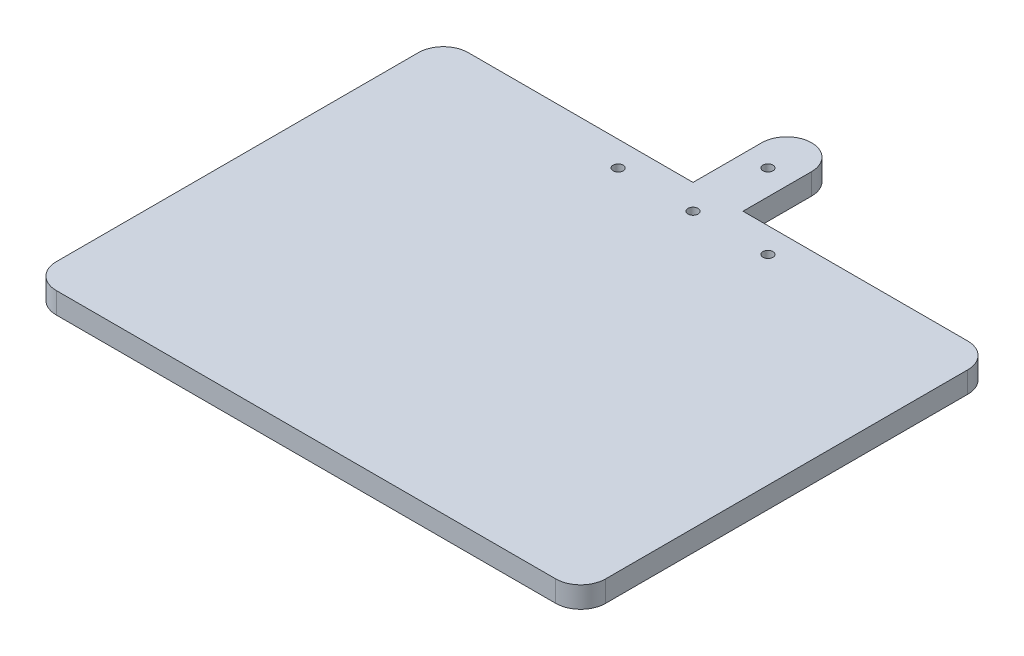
ISO-10303-21;
HEADER;
FILE_DESCRIPTION(('STEP AP214'),'2;1');
FILE_NAME('part.step','',(''),(''),'','','');
FILE_SCHEMA(('AUTOMOTIVE_DESIGN { 1 0 10303 214 1 1 1 1 }'));
ENDSEC;
DATA;
#1=APPLICATION_CONTEXT('core data for automotive mechanical design processes');
#2=APPLICATION_PROTOCOL_DEFINITION('international standard','automotive_design',2000,#1);
#3=PRODUCT_CONTEXT('',#1,'mechanical');
#4=PRODUCT('Part','Part','',(#3));
#5=PRODUCT_RELATED_PRODUCT_CATEGORY('part','',(#4));
#6=PRODUCT_DEFINITION_FORMATION('','',#4);
#7=PRODUCT_DEFINITION_CONTEXT('part definition',#1,'design');
#8=PRODUCT_DEFINITION('design','',#6,#7);
#9=PRODUCT_DEFINITION_SHAPE('','',#8);
#10=(LENGTH_UNIT() NAMED_UNIT(*) SI_UNIT(.MILLI.,.METRE.));
#11=(NAMED_UNIT(*) PLANE_ANGLE_UNIT() SI_UNIT($,.RADIAN.));
#12=(NAMED_UNIT(*) SI_UNIT($,.STERADIAN.) SOLID_ANGLE_UNIT());
#13=UNCERTAINTY_MEASURE_WITH_UNIT(LENGTH_MEASURE(1.E-05),#10,'distance_accuracy_value','');
#14=(GEOMETRIC_REPRESENTATION_CONTEXT(3) GLOBAL_UNCERTAINTY_ASSIGNED_CONTEXT((#13)) GLOBAL_UNIT_ASSIGNED_CONTEXT((#10,
#11,#12)) REPRESENTATION_CONTEXT('',''));
#15=CARTESIAN_POINT('',(0.,0.,0.));
#16=DIRECTION('',(0.,0.,1.));
#17=DIRECTION('',(1.,0.,0.));
#18=AXIS2_PLACEMENT_3D('',#15,#16,#17);
#19=CARTESIAN_POINT('',(0.,-8.5,-87.4904896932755));
#20=DIRECTION('',(0.,-1.,0.));
#21=DIRECTION('',(0.,0.,-1.));
#22=AXIS2_PLACEMENT_3D('',#19,#20,#21);
#23=CYLINDRICAL_SURFACE('',#22,1.99999999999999);
#24=CARTESIAN_POINT('',(0.,0.,-87.4904896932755));
#25=DIRECTION('',(0.,-1.,0.));
#26=DIRECTION('',(0.,0.,-1.));
#27=AXIS2_PLACEMENT_3D('',#24,#25,#26);
#28=CIRCLE('',#27,2.);
#29=CARTESIAN_POINT('',(0.,0.,-89.4904896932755));
#30=VERTEX_POINT('',#29);
#31=EDGE_CURVE('E185',#30,#30,#28,.T.);
#32=ORIENTED_EDGE('',*,*,#31,.F.);
#33=EDGE_LOOP('',(#32));
#34=FACE_BOUND('',#33,.T.);
#35=CARTESIAN_POINT('',(0.,-6.00000000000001,-87.4904896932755));
#36=DIRECTION('',(0.,-1.,0.));
#37=DIRECTION('',(0.,0.,-1.));
#38=AXIS2_PLACEMENT_3D('',#35,#36,#37);
#39=CIRCLE('',#38,1.99999999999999);
#40=CARTESIAN_POINT('',(0.,-6.00000000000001,-89.4904896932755));
#41=VERTEX_POINT('',#40);
#42=EDGE_CURVE('E75',#41,#41,#39,.F.);
#43=ORIENTED_EDGE('',*,*,#42,.F.);
#44=EDGE_LOOP('',(#43));
#45=FACE_BOUND('',#44,.T.);
#46=ADVANCED_FACE('F71',(#34,#45),#23,.F.);
#47=CARTESIAN_POINT('',(30.,-8.5,-57.4904896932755));
#48=DIRECTION('',(0.,-1.,0.));
#49=DIRECTION('',(0.,0.,-1.));
#50=AXIS2_PLACEMENT_3D('',#47,#48,#49);
#51=CYLINDRICAL_SURFACE('',#50,1.99999999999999);
#52=CARTESIAN_POINT('',(30.,0.,-57.4904896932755));
#53=DIRECTION('',(0.,-1.,0.));
#54=DIRECTION('',(0.,0.,-1.));
#55=AXIS2_PLACEMENT_3D('',#52,#53,#54);
#56=CIRCLE('',#55,1.99999999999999);
#57=CARTESIAN_POINT('',(30.,0.,-59.4904896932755));
#58=VERTEX_POINT('',#57);
#59=EDGE_CURVE('E281',#58,#58,#56,.T.);
#60=ORIENTED_EDGE('',*,*,#59,.F.);
#61=EDGE_LOOP('',(#60));
#62=FACE_BOUND('',#61,.T.);
#63=CARTESIAN_POINT('',(30.,-6.00000000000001,-57.4904896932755));
#64=DIRECTION('',(0.,-1.,0.));
#65=DIRECTION('',(0.,0.,-1.));
#66=AXIS2_PLACEMENT_3D('',#63,#64,#65);
#67=CIRCLE('',#66,1.99999999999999);
#68=CARTESIAN_POINT('',(30.,-6.00000000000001,-59.4904896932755));
#69=VERTEX_POINT('',#68);
#70=EDGE_CURVE('E267',#69,#69,#67,.F.);
#71=ORIENTED_EDGE('',*,*,#70,.F.);
#72=EDGE_LOOP('',(#71));
#73=FACE_BOUND('',#72,.T.);
#74=ADVANCED_FACE('F295',(#62,#73),#51,.F.);
#75=CARTESIAN_POINT('',(0.,-8.5,-57.4904896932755));
#76=DIRECTION('',(0.,-1.,0.));
#77=DIRECTION('',(0.,0.,-1.));
#78=AXIS2_PLACEMENT_3D('',#75,#76,#77);
#79=CYLINDRICAL_SURFACE('',#78,1.99999999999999);
#80=CARTESIAN_POINT('',(0.,0.,-57.4904896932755));
#81=DIRECTION('',(0.,-1.,0.));
#82=DIRECTION('',(0.,0.,-1.));
#83=AXIS2_PLACEMENT_3D('',#80,#81,#82);
#84=CIRCLE('',#83,2.);
#85=CARTESIAN_POINT('',(0.,0.,-59.4904896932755));
#86=VERTEX_POINT('',#85);
#87=EDGE_CURVE('E276',#86,#86,#84,.T.);
#88=ORIENTED_EDGE('',*,*,#87,.F.);
#89=EDGE_LOOP('',(#88));
#90=FACE_BOUND('',#89,.T.);
#91=CARTESIAN_POINT('',(0.,-6.00000000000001,-57.4904896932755));
#92=DIRECTION('',(0.,-1.,0.));
#93=DIRECTION('',(0.,0.,-1.));
#94=AXIS2_PLACEMENT_3D('',#91,#92,#93);
#95=CIRCLE('',#94,1.99999999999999);
#96=CARTESIAN_POINT('',(0.,-6.00000000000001,-59.4904896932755));
#97=VERTEX_POINT('',#96);
#98=EDGE_CURVE('E264',#97,#97,#95,.F.);
#99=ORIENTED_EDGE('',*,*,#98,.F.);
#100=EDGE_LOOP('',(#99));
#101=FACE_BOUND('',#100,.T.);
#102=ADVANCED_FACE('F300',(#90,#101),#79,.F.);
#103=CARTESIAN_POINT('',(-30.,-8.5,-57.4904896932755));
#104=DIRECTION('',(0.,-1.,0.));
#105=DIRECTION('',(0.,0.,-1.));
#106=AXIS2_PLACEMENT_3D('',#103,#104,#105);
#107=CYLINDRICAL_SURFACE('',#106,1.99999999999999);
#108=CARTESIAN_POINT('',(-30.,0.,-57.4904896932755));
#109=DIRECTION('',(0.,-1.,0.));
#110=DIRECTION('',(0.,0.,-1.));
#111=AXIS2_PLACEMENT_3D('',#108,#109,#110);
#112=CIRCLE('',#111,2.);
#113=CARTESIAN_POINT('',(-30.,0.,-59.4904896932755));
#114=VERTEX_POINT('',#113);
#115=EDGE_CURVE('E272',#114,#114,#112,.T.);
#116=ORIENTED_EDGE('',*,*,#115,.F.);
#117=EDGE_LOOP('',(#116));
#118=FACE_BOUND('',#117,.T.);
#119=CARTESIAN_POINT('',(-30.,-6.00000000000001,-57.4904896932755));
#120=DIRECTION('',(0.,-1.,0.));
#121=DIRECTION('',(0.,0.,-1.));
#122=AXIS2_PLACEMENT_3D('',#119,#120,#121);
#123=CIRCLE('',#122,1.99999999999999);
#124=CARTESIAN_POINT('',(-30.,-6.00000000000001,-59.4904896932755));
#125=VERTEX_POINT('',#124);
#126=EDGE_CURVE('E261',#125,#125,#123,.F.);
#127=ORIENTED_EDGE('',*,*,#126,.F.);
#128=EDGE_LOOP('',(#127));
#129=FACE_BOUND('',#128,.T.);
#130=ADVANCED_FACE('F346',(#118,#129),#107,.F.);
#131=CARTESIAN_POINT('',(12.5,-8.50000000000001,0.));
#132=DIRECTION('',(0.,1.,0.));
#133=DIRECTION('',(0.,0.,1.));
#134=AXIS2_PLACEMENT_3D('',#131,#132,#133);
#135=PLANE('',#134);
#136=CARTESIAN_POINT('',(0.,-8.50000000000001,-87.4904896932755));
#137=DIRECTION('',(0.,-1.,0.));
#138=DIRECTION('',(0.,0.,-1.));
#139=AXIS2_PLACEMENT_3D('',#136,#137,#138);
#140=CIRCLE('',#139,4.);
#141=CARTESIAN_POINT('',(0.,-8.50000000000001,-91.4904896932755));
#142=VERTEX_POINT('',#141);
#143=EDGE_CURVE('E576',#142,#142,#140,.T.);
#144=ORIENTED_EDGE('',*,*,#143,.F.);
#145=EDGE_LOOP('',(#144));
#146=FACE_BOUND('',#145,.T.);
#147=CARTESIAN_POINT('',(30.,-8.50000000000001,-57.4904896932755));
#148=DIRECTION('',(0.,-1.,0.));
#149=DIRECTION('',(0.,0.,-1.));
#150=AXIS2_PLACEMENT_3D('',#147,#148,#149);
#151=CIRCLE('',#150,4.00000000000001);
#152=CARTESIAN_POINT('',(30.,-8.50000000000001,-61.4904896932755));
#153=VERTEX_POINT('',#152);
#154=EDGE_CURVE('E578',#153,#153,#151,.T.);
#155=ORIENTED_EDGE('',*,*,#154,.F.);
#156=EDGE_LOOP('',(#155));
#157=FACE_BOUND('',#156,.T.);
#158=CARTESIAN_POINT('',(-30.,-8.50000000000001,-57.4904896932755));
#159=DIRECTION('',(0.,-1.,0.));
#160=DIRECTION('',(0.,0.,-1.));
#161=AXIS2_PLACEMENT_3D('',#158,#159,#160);
#162=CIRCLE('',#161,4.);
#163=CARTESIAN_POINT('',(-30.,-8.50000000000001,-61.4904896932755));
#164=VERTEX_POINT('',#163);
#165=EDGE_CURVE('E588',#164,#164,#162,.T.);
#166=ORIENTED_EDGE('',*,*,#165,.F.);
#167=EDGE_LOOP('',(#166));
#168=FACE_BOUND('',#167,.T.);
#169=CARTESIAN_POINT('',(0.,-8.50000000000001,-57.4904896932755));
#170=DIRECTION('',(0.,-1.,0.));
#171=DIRECTION('',(0.,0.,-1.));
#172=AXIS2_PLACEMENT_3D('',#169,#170,#171);
#173=CIRCLE('',#172,4.);
#174=CARTESIAN_POINT('',(0.,-8.50000000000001,-61.4904896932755));
#175=VERTEX_POINT('',#174);
#176=EDGE_CURVE('E284',#175,#175,#173,.T.);
#177=ORIENTED_EDGE('',*,*,#176,.F.);
#178=EDGE_LOOP('',(#177));
#179=FACE_BOUND('',#178,.T.);
#180=CARTESIAN_POINT('',(0.,-8.50000000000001,-94.9904896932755));
#181=DIRECTION('',(0.,1.,0.));
#182=DIRECTION('',(0.,0.,1.));
#183=AXIS2_PLACEMENT_3D('',#180,#181,#182);
#184=CIRCLE('',#183,10.);
#185=CARTESIAN_POINT('',(-10.,-8.50000000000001,-94.9904896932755));
#186=VERTEX_POINT('',#185);
#187=CARTESIAN_POINT('',(0.,-8.50000000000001,-104.990489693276));
#188=VERTEX_POINT('',#187);
#189=EDGE_CURVE('E253',#186,#188,#184,.F.);
#190=ORIENTED_EDGE('',*,*,#189,.T.);
#191=CARTESIAN_POINT('',(0.,-8.50000000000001,-94.9904896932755));
#192=DIRECTION('',(0.,1.,0.));
#193=DIRECTION('',(0.,0.,1.));
#194=AXIS2_PLACEMENT_3D('',#191,#192,#193);
#195=CIRCLE('',#194,10.);
#196=CARTESIAN_POINT('',(10.,-8.50000000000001,-94.9904896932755));
#197=VERTEX_POINT('',#196);
#198=EDGE_CURVE('E255',#188,#197,#195,.F.);
#199=ORIENTED_EDGE('',*,*,#198,.T.);
#200=DIRECTION('',(0.,0.,1.));
#201=VECTOR('',#200,1.);
#202=CARTESIAN_POINT('',(10.,-8.50000000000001,-104.990489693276));
#203=LINE('',#202,#201);
#204=CARTESIAN_POINT('',(10.,-8.50000000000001,-67.4904896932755));
#205=VERTEX_POINT('',#204);
#206=EDGE_CURVE('E200',#197,#205,#203,.T.);
#207=ORIENTED_EDGE('',*,*,#206,.T.);
#208=DIRECTION('',(1.,0.,0.));
#209=VECTOR('',#208,1.);
#210=CARTESIAN_POINT('',(-100.,-8.50000000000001,-67.4904896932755));
#211=LINE('',#210,#209);
#212=CARTESIAN_POINT('',(100.,-8.50000000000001,-67.4904896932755));
#213=VERTEX_POINT('',#212);
#214=EDGE_CURVE('E189',#205,#213,#211,.T.);
#215=ORIENTED_EDGE('',*,*,#214,.T.);
#216=CARTESIAN_POINT('',(100.,-8.50000000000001,-57.4904896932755));
#217=DIRECTION('',(0.,1.,0.));
#218=DIRECTION('',(0.,0.,1.));
#219=AXIS2_PLACEMENT_3D('',#216,#217,#218);
#220=CIRCLE('',#219,10.);
#221=CARTESIAN_POINT('',(110.,-8.50000000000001,-57.4904896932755));
#222=VERTEX_POINT('',#221);
#223=EDGE_CURVE('E208',#213,#222,#220,.F.);
#224=ORIENTED_EDGE('',*,*,#223,.T.);
#225=DIRECTION('',(0.,0.,1.));
#226=VECTOR('',#225,1.);
#227=CARTESIAN_POINT('',(110.,-8.50000000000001,-57.4904896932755));
#228=LINE('',#227,#226);
#229=CARTESIAN_POINT('',(110.,-8.50000000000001,87.5095103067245));
#230=VERTEX_POINT('',#229);
#231=EDGE_CURVE('E205',#222,#230,#228,.T.);
#232=ORIENTED_EDGE('',*,*,#231,.T.);
#233=CARTESIAN_POINT('',(100.,-8.50000000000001,87.5095103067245));
#234=DIRECTION('',(0.,1.,0.));
#235=DIRECTION('',(0.,0.,1.));
#236=AXIS2_PLACEMENT_3D('',#233,#234,#235);
#237=CIRCLE('',#236,9.99999999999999);
#238=CARTESIAN_POINT('',(100.,-8.50000000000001,97.5095103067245));
#239=VERTEX_POINT('',#238);
#240=EDGE_CURVE('E203',#230,#239,#237,.F.);
#241=ORIENTED_EDGE('',*,*,#240,.T.);
#242=DIRECTION('',(-1.,0.,0.));
#243=VECTOR('',#242,1.);
#244=CARTESIAN_POINT('',(-100.,-8.50000000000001,97.5095103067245));
#245=LINE('',#244,#243);
#246=CARTESIAN_POINT('',(-100.,-8.50000000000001,97.5095103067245));
#247=VERTEX_POINT('',#246);
#248=EDGE_CURVE('E219',#239,#247,#245,.T.);
#249=ORIENTED_EDGE('',*,*,#248,.T.);
#250=CARTESIAN_POINT('',(-100.,-8.50000000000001,87.5095103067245));
#251=DIRECTION('',(0.,1.,0.));
#252=DIRECTION('',(0.,0.,1.));
#253=AXIS2_PLACEMENT_3D('',#250,#251,#252);
#254=CIRCLE('',#253,9.99999999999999);
#255=CARTESIAN_POINT('',(-110.,-8.50000000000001,87.5095103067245));
#256=VERTEX_POINT('',#255);
#257=EDGE_CURVE('E217',#247,#256,#254,.F.);
#258=ORIENTED_EDGE('',*,*,#257,.T.);
#259=DIRECTION('',(0.,0.,-1.));
#260=VECTOR('',#259,1.);
#261=CARTESIAN_POINT('',(-110.,-8.50000000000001,-57.4904896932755));
#262=LINE('',#261,#260);
#263=CARTESIAN_POINT('',(-110.,-8.50000000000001,-57.4904896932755));
#264=VERTEX_POINT('',#263);
#265=EDGE_CURVE('E215',#256,#264,#262,.T.);
#266=ORIENTED_EDGE('',*,*,#265,.T.);
#267=CARTESIAN_POINT('',(-100.,-8.50000000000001,-57.4904896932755));
#268=DIRECTION('',(0.,1.,0.));
#269=DIRECTION('',(0.,0.,1.));
#270=AXIS2_PLACEMENT_3D('',#267,#268,#269);
#271=CIRCLE('',#270,10.);
#272=CARTESIAN_POINT('',(-100.,-8.50000000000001,-67.4904896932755));
#273=VERTEX_POINT('',#272);
#274=EDGE_CURVE('E213',#264,#273,#271,.F.);
#275=ORIENTED_EDGE('',*,*,#274,.T.);
#276=CARTESIAN_POINT('',(-9.99999999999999,-8.50000000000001,-67.4904896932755));
#277=VERTEX_POINT('',#276);
#278=EDGE_CURVE('E210',#273,#277,#211,.T.);
#279=ORIENTED_EDGE('',*,*,#278,.T.);
#280=DIRECTION('',(0.,0.,1.));
#281=VECTOR('',#280,1.);
#282=CARTESIAN_POINT('',(-10.,-8.50000000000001,-104.990489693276));
#283=LINE('',#282,#281);
#284=EDGE_CURVE('E194',#186,#277,#283,.T.);
#285=ORIENTED_EDGE('',*,*,#284,.F.);
#286=EDGE_LOOP('',(#190,#199,#207,#215,#224,#232,#241,#249,#258,#266,#275,#279,#285));
#287=FACE_BOUND('',#286,.T.);
#288=ADVANCED_FACE('F325',(#146,#157,#168,#179,#287),#135,.F.);
#289=CARTESIAN_POINT('',(-100.,-283.5,-67.4904896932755));
#290=DIRECTION('',(0.,0.,-1.));
#291=DIRECTION('',(-1.,0.,0.));
#292=AXIS2_PLACEMENT_3D('',#289,#290,#291);
#293=PLANE('',#292);
#294=ORIENTED_EDGE('',*,*,#214,.F.);
#295=DIRECTION('',(0.,-1.,0.));
#296=VECTOR('',#295,1.);
#297=CARTESIAN_POINT('',(10.,0.,-67.4904896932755));
#298=LINE('',#297,#296);
#299=CARTESIAN_POINT('',(9.99999999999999,0.,-67.4904896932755));
#300=VERTEX_POINT('',#299);
#301=EDGE_CURVE('E182',#300,#205,#298,.T.);
#302=ORIENTED_EDGE('',*,*,#301,.F.);
#303=DIRECTION('',(-1.,0.,0.));
#304=VECTOR('',#303,1.);
#305=CARTESIAN_POINT('',(-100.,0.,-67.4904896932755));
#306=LINE('',#305,#304);
#307=CARTESIAN_POINT('',(100.,0.,-67.4904896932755));
#308=VERTEX_POINT('',#307);
#309=EDGE_CURVE('E164',#308,#300,#306,.T.);
#310=ORIENTED_EDGE('',*,*,#309,.F.);
#311=DIRECTION('',(0.,1.,0.));
#312=VECTOR('',#311,1.);
#313=CARTESIAN_POINT('',(100.,-283.5,-67.4904896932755));
#314=LINE('',#313,#312);
#315=EDGE_CURVE('E243',#213,#308,#314,.T.);
#316=ORIENTED_EDGE('',*,*,#315,.F.);
#317=EDGE_LOOP('',(#294,#302,#310,#316));
#318=FACE_BOUND('',#317,.T.);
#319=ADVANCED_FACE('F188',(#318),#293,.T.);
#320=CARTESIAN_POINT('',(-10.,0.,-67.4904896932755));
#321=VERTEX_POINT('',#320);
#322=CARTESIAN_POINT('',(-100.,0.,-67.4904896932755));
#323=VERTEX_POINT('',#322);
#324=EDGE_CURVE('E176',#321,#323,#306,.T.);
#325=ORIENTED_EDGE('',*,*,#324,.F.);
#326=DIRECTION('',(0.,1.,0.));
#327=VECTOR('',#326,1.);
#328=CARTESIAN_POINT('',(-10.,0.,-67.4904896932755));
#329=LINE('',#328,#327);
#330=EDGE_CURVE('E190',#277,#321,#329,.T.);
#331=ORIENTED_EDGE('',*,*,#330,.F.);
#332=ORIENTED_EDGE('',*,*,#278,.F.);
#333=DIRECTION('',(0.,1.,0.));
#334=VECTOR('',#333,1.);
#335=CARTESIAN_POINT('',(-100.,-283.5,-67.4904896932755));
#336=LINE('',#335,#334);
#337=EDGE_CURVE('E240',#273,#323,#336,.T.);
#338=ORIENTED_EDGE('',*,*,#337,.T.);
#339=EDGE_LOOP('',(#325,#331,#332,#338));
#340=FACE_BOUND('',#339,.T.);
#341=ADVANCED_FACE('F324',(#340),#293,.T.);
#342=CARTESIAN_POINT('',(12.5,0.,-47.49));
#343=DIRECTION('',(0.,-1.,0.));
#344=DIRECTION('',(0.,0.,-1.));
#345=AXIS2_PLACEMENT_3D('',#342,#343,#344);
#346=PLANE('',#345);
#347=ORIENTED_EDGE('',*,*,#115,.T.);
#348=EDGE_LOOP('',(#347));
#349=FACE_BOUND('',#348,.T.);
#350=ORIENTED_EDGE('',*,*,#87,.T.);
#351=EDGE_LOOP('',(#350));
#352=FACE_BOUND('',#351,.T.);
#353=ORIENTED_EDGE('',*,*,#59,.T.);
#354=EDGE_LOOP('',(#353));
#355=FACE_BOUND('',#354,.T.);
#356=ORIENTED_EDGE('',*,*,#31,.T.);
#357=EDGE_LOOP('',(#356));
#358=FACE_BOUND('',#357,.T.);
#359=ORIENTED_EDGE('',*,*,#309,.T.);
#360=DIRECTION('',(0.,0.,1.));
#361=VECTOR('',#360,1.);
#362=CARTESIAN_POINT('',(9.99999999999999,0.,-110.49));
#363=LINE('',#362,#361);
#364=CARTESIAN_POINT('',(9.99999999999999,0.,-94.9904896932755));
#365=VERTEX_POINT('',#364);
#366=EDGE_CURVE('E167',#365,#300,#363,.T.);
#367=ORIENTED_EDGE('',*,*,#366,.F.);
#368=CARTESIAN_POINT('',(0.,0.,-94.9904896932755));
#369=DIRECTION('',(0.,-1.,0.));
#370=DIRECTION('',(1.,0.,0.));
#371=AXIS2_PLACEMENT_3D('',#368,#369,#370);
#372=CIRCLE('',#371,10.);
#373=CARTESIAN_POINT('',(0.,0.,-104.990489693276));
#374=VERTEX_POINT('',#373);
#375=EDGE_CURVE('E80',#365,#374,#372,.F.);
#376=ORIENTED_EDGE('',*,*,#375,.T.);
#377=CARTESIAN_POINT('',(0.,0.,-94.9904896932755));
#378=DIRECTION('',(0.,-1.,0.));
#379=DIRECTION('',(1.,0.,0.));
#380=AXIS2_PLACEMENT_3D('',#377,#378,#379);
#381=CIRCLE('',#380,10.);
#382=CARTESIAN_POINT('',(-10.,0.,-94.9904896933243));
#383=VERTEX_POINT('',#382);
#384=EDGE_CURVE('E258',#374,#383,#381,.F.);
#385=ORIENTED_EDGE('',*,*,#384,.T.);
#386=DIRECTION('',(0.,0.,-1.));
#387=VECTOR('',#386,1.);
#388=CARTESIAN_POINT('',(-10.,0.,-110.49));
#389=LINE('',#388,#387);
#390=EDGE_CURVE('E184',#321,#383,#389,.T.);
#391=ORIENTED_EDGE('',*,*,#390,.F.);
#392=ORIENTED_EDGE('',*,*,#324,.T.);
#393=CARTESIAN_POINT('',(-100.,0.,-57.4904896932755));
#394=DIRECTION('',(0.,1.,0.));
#395=DIRECTION('',(0.,0.,1.));
#396=AXIS2_PLACEMENT_3D('',#393,#394,#395);
#397=CIRCLE('',#396,10.);
#398=CARTESIAN_POINT('',(-110.,0.,-57.4904896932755));
#399=VERTEX_POINT('',#398);
#400=EDGE_CURVE('E175',#323,#399,#397,.T.);
#401=ORIENTED_EDGE('',*,*,#400,.T.);
#402=DIRECTION('',(0.,0.,1.));
#403=VECTOR('',#402,1.);
#404=CARTESIAN_POINT('',(-110.,0.,-57.4904896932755));
#405=LINE('',#404,#403);
#406=CARTESIAN_POINT('',(-110.,0.,87.5095103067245));
#407=VERTEX_POINT('',#406);
#408=EDGE_CURVE('E233',#399,#407,#405,.T.);
#409=ORIENTED_EDGE('',*,*,#408,.T.);
#410=CARTESIAN_POINT('',(-100.,0.,87.5095103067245));
#411=DIRECTION('',(0.,1.,0.));
#412=DIRECTION('',(0.,0.,1.));
#413=AXIS2_PLACEMENT_3D('',#410,#411,#412);
#414=CIRCLE('',#413,9.99999999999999);
#415=CARTESIAN_POINT('',(-100.,0.,97.5095103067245));
#416=VERTEX_POINT('',#415);
#417=EDGE_CURVE('E202',#407,#416,#414,.T.);
#418=ORIENTED_EDGE('',*,*,#417,.T.);
#419=DIRECTION('',(1.,0.,0.));
#420=VECTOR('',#419,1.);
#421=CARTESIAN_POINT('',(-100.,0.,97.5095103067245));
#422=LINE('',#421,#420);
#423=CARTESIAN_POINT('',(100.,0.,97.5095103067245));
#424=VERTEX_POINT('',#423);
#425=EDGE_CURVE('E222',#416,#424,#422,.T.);
#426=ORIENTED_EDGE('',*,*,#425,.T.);
#427=CARTESIAN_POINT('',(100.,0.,87.5095103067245));
#428=DIRECTION('',(0.,1.,0.));
#429=DIRECTION('',(0.,0.,1.));
#430=AXIS2_PLACEMENT_3D('',#427,#428,#429);
#431=CIRCLE('',#430,9.99999999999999);
#432=CARTESIAN_POINT('',(110.,0.,87.5095103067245));
#433=VERTEX_POINT('',#432);
#434=EDGE_CURVE('E225',#424,#433,#431,.T.);
#435=ORIENTED_EDGE('',*,*,#434,.T.);
#436=DIRECTION('',(0.,0.,-1.));
#437=VECTOR('',#436,1.);
#438=CARTESIAN_POINT('',(110.,0.,-57.4904896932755));
#439=LINE('',#438,#437);
#440=CARTESIAN_POINT('',(110.,0.,-57.4904896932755));
#441=VERTEX_POINT('',#440);
#442=EDGE_CURVE('E228',#433,#441,#439,.T.);
#443=ORIENTED_EDGE('',*,*,#442,.T.);
#444=CARTESIAN_POINT('',(100.,0.,-57.4904896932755));
#445=DIRECTION('',(0.,1.,0.));
#446=DIRECTION('',(0.,0.,-1.));
#447=AXIS2_PLACEMENT_3D('',#444,#445,#446);
#448=CIRCLE('',#447,10.);
#449=EDGE_CURVE('E171',#441,#308,#448,.T.);
#450=ORIENTED_EDGE('',*,*,#449,.T.);
#451=EDGE_LOOP('',(#359,#367,#376,#385,#391,#392,#401,#409,#418,#426,#435,#443,#450));
#452=FACE_BOUND('',#451,.T.);
#453=ADVANCED_FACE('F166',(#349,#352,#355,#358,#452),#346,.F.);
#454=CARTESIAN_POINT('',(-100.,-283.5,87.5095103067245));
#455=DIRECTION('',(0.,1.,0.));
#456=DIRECTION('',(0.,0.,1.));
#457=AXIS2_PLACEMENT_3D('',#454,#455,#456);
#458=CYLINDRICAL_SURFACE('',#457,9.99999999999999);
#459=ORIENTED_EDGE('',*,*,#257,.F.);
#460=DIRECTION('',(0.,1.,0.));
#461=VECTOR('',#460,1.);
#462=CARTESIAN_POINT('',(-100.,-283.5,97.5095103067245));
#463=LINE('',#462,#461);
#464=EDGE_CURVE('E236',#247,#416,#463,.T.);
#465=ORIENTED_EDGE('',*,*,#464,.T.);
#466=ORIENTED_EDGE('',*,*,#417,.F.);
#467=DIRECTION('',(0.,1.,0.));
#468=VECTOR('',#467,1.);
#469=CARTESIAN_POINT('',(-110.,-283.5,87.5095103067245));
#470=LINE('',#469,#468);
#471=EDGE_CURVE('E206',#256,#407,#470,.T.);
#472=ORIENTED_EDGE('',*,*,#471,.F.);
#473=EDGE_LOOP('',(#459,#465,#466,#472));
#474=FACE_BOUND('',#473,.T.);
#475=ADVANCED_FACE('F316',(#474),#458,.T.);
#476=CARTESIAN_POINT('',(-110.,-283.5,-57.4904896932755));
#477=DIRECTION('',(-1.,0.,0.));
#478=DIRECTION('',(0.,0.,1.));
#479=AXIS2_PLACEMENT_3D('',#476,#477,#478);
#480=PLANE('',#479);
#481=ORIENTED_EDGE('',*,*,#265,.F.);
#482=ORIENTED_EDGE('',*,*,#471,.T.);
#483=ORIENTED_EDGE('',*,*,#408,.F.);
#484=DIRECTION('',(0.,1.,0.));
#485=VECTOR('',#484,1.);
#486=CARTESIAN_POINT('',(-110.,-283.5,-57.4904896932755));
#487=LINE('',#486,#485);
#488=EDGE_CURVE('E238',#264,#399,#487,.T.);
#489=ORIENTED_EDGE('',*,*,#488,.F.);
#490=EDGE_LOOP('',(#481,#482,#483,#489));
#491=FACE_BOUND('',#490,.T.);
#492=ADVANCED_FACE('F312',(#491),#480,.T.);
#493=CARTESIAN_POINT('',(-100.,-283.5,-57.4904896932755));
#494=DIRECTION('',(0.,1.,0.));
#495=DIRECTION('',(0.,0.,1.));
#496=AXIS2_PLACEMENT_3D('',#493,#494,#495);
#497=CYLINDRICAL_SURFACE('',#496,10.);
#498=ORIENTED_EDGE('',*,*,#274,.F.);
#499=ORIENTED_EDGE('',*,*,#488,.T.);
#500=ORIENTED_EDGE('',*,*,#400,.F.);
#501=ORIENTED_EDGE('',*,*,#337,.F.);
#502=EDGE_LOOP('',(#498,#499,#500,#501));
#503=FACE_BOUND('',#502,.T.);
#504=ADVANCED_FACE('F315',(#503),#497,.T.);
#505=CARTESIAN_POINT('',(100.,-283.5,-57.4904896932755));
#506=DIRECTION('',(0.,1.,0.));
#507=DIRECTION('',(0.,0.,1.));
#508=AXIS2_PLACEMENT_3D('',#505,#506,#507);
#509=CYLINDRICAL_SURFACE('',#508,10.);
#510=ORIENTED_EDGE('',*,*,#223,.F.);
#511=ORIENTED_EDGE('',*,*,#315,.T.);
#512=ORIENTED_EDGE('',*,*,#449,.F.);
#513=DIRECTION('',(0.,1.,0.));
#514=VECTOR('',#513,1.);
#515=CARTESIAN_POINT('',(110.,-283.5,-57.4904896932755));
#516=LINE('',#515,#514);
#517=EDGE_CURVE('E245',#222,#441,#516,.T.);
#518=ORIENTED_EDGE('',*,*,#517,.F.);
#519=EDGE_LOOP('',(#510,#511,#512,#518));
#520=FACE_BOUND('',#519,.T.);
#521=ADVANCED_FACE('F320',(#520),#509,.T.);
#522=CARTESIAN_POINT('',(110.,-283.5,-57.4904896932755));
#523=DIRECTION('',(1.,0.,0.));
#524=DIRECTION('',(0.,0.,-1.));
#525=AXIS2_PLACEMENT_3D('',#522,#523,#524);
#526=PLANE('',#525);
#527=ORIENTED_EDGE('',*,*,#231,.F.);
#528=ORIENTED_EDGE('',*,*,#517,.T.);
#529=ORIENTED_EDGE('',*,*,#442,.F.);
#530=DIRECTION('',(0.,1.,0.));
#531=VECTOR('',#530,1.);
#532=CARTESIAN_POINT('',(110.,-283.5,87.5095103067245));
#533=LINE('',#532,#531);
#534=EDGE_CURVE('E247',#230,#433,#533,.T.);
#535=ORIENTED_EDGE('',*,*,#534,.F.);
#536=EDGE_LOOP('',(#527,#528,#529,#535));
#537=FACE_BOUND('',#536,.T.);
#538=ADVANCED_FACE('F328',(#537),#526,.T.);
#539=CARTESIAN_POINT('',(100.,-283.5,87.5095103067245));
#540=DIRECTION('',(0.,1.,0.));
#541=DIRECTION('',(0.,0.,1.));
#542=AXIS2_PLACEMENT_3D('',#539,#540,#541);
#543=CYLINDRICAL_SURFACE('',#542,9.99999999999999);
#544=ORIENTED_EDGE('',*,*,#240,.F.);
#545=ORIENTED_EDGE('',*,*,#534,.T.);
#546=ORIENTED_EDGE('',*,*,#434,.F.);
#547=DIRECTION('',(0.,1.,0.));
#548=VECTOR('',#547,1.);
#549=CARTESIAN_POINT('',(100.,-283.5,97.5095103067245));
#550=LINE('',#549,#548);
#551=EDGE_CURVE('E249',#239,#424,#550,.T.);
#552=ORIENTED_EDGE('',*,*,#551,.F.);
#553=EDGE_LOOP('',(#544,#545,#546,#552));
#554=FACE_BOUND('',#553,.T.);
#555=ADVANCED_FACE('F332',(#554),#543,.T.);
#556=CARTESIAN_POINT('',(-100.,-283.5,97.5095103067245));
#557=DIRECTION('',(0.,0.,1.));
#558=DIRECTION('',(1.,0.,0.));
#559=AXIS2_PLACEMENT_3D('',#556,#557,#558);
#560=PLANE('',#559);
#561=ORIENTED_EDGE('',*,*,#248,.F.);
#562=ORIENTED_EDGE('',*,*,#551,.T.);
#563=ORIENTED_EDGE('',*,*,#425,.F.);
#564=ORIENTED_EDGE('',*,*,#464,.F.);
#565=EDGE_LOOP('',(#561,#562,#563,#564));
#566=FACE_BOUND('',#565,.T.);
#567=ADVANCED_FACE('F311',(#566),#560,.T.);
#568=CARTESIAN_POINT('',(10.,68.,-110.49));
#569=DIRECTION('',(-1.,0.,0.));
#570=DIRECTION('',(0.,-1.,0.));
#571=AXIS2_PLACEMENT_3D('',#568,#569,#570);
#572=PLANE('',#571);
#573=DIRECTION('',(0.,-1.,0.));
#574=VECTOR('',#573,1.);
#575=CARTESIAN_POINT('',(9.99999999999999,0.,-94.9904896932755));
#576=LINE('',#575,#574);
#577=EDGE_CURVE('E183',#197,#365,#576,.F.);
#578=ORIENTED_EDGE('',*,*,#577,.T.);
#579=ORIENTED_EDGE('',*,*,#366,.T.);
#580=ORIENTED_EDGE('',*,*,#301,.T.);
#581=ORIENTED_EDGE('',*,*,#206,.F.);
#582=EDGE_LOOP('',(#578,#579,#580,#581));
#583=FACE_BOUND('',#582,.T.);
#584=ADVANCED_FACE('F180',(#583),#572,.F.);
#585=CARTESIAN_POINT('',(-10.,68.,-110.49));
#586=DIRECTION('',(1.,0.,0.));
#587=DIRECTION('',(0.,1.,0.));
#588=AXIS2_PLACEMENT_3D('',#585,#586,#587);
#589=PLANE('',#588);
#590=ORIENTED_EDGE('',*,*,#330,.T.);
#591=ORIENTED_EDGE('',*,*,#390,.T.);
#592=DIRECTION('',(0.,1.,0.));
#593=VECTOR('',#592,1.);
#594=CARTESIAN_POINT('',(-10.,-8.50000000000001,-94.9904896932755));
#595=LINE('',#594,#593);
#596=EDGE_CURVE('E12',#383,#186,#595,.F.);
#597=ORIENTED_EDGE('',*,*,#596,.T.);
#598=ORIENTED_EDGE('',*,*,#284,.T.);
#599=EDGE_LOOP('',(#590,#591,#597,#598));
#600=FACE_BOUND('',#599,.T.);
#601=ADVANCED_FACE('F305',(#600),#589,.F.);
#602=CARTESIAN_POINT('',(0.,0.,-94.9904896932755));
#603=DIRECTION('',(0.,-1.,0.));
#604=DIRECTION('',(1.,0.,0.));
#605=AXIS2_PLACEMENT_3D('',#602,#603,#604);
#606=CYLINDRICAL_SURFACE('',#605,10.);
#607=ORIENTED_EDGE('',*,*,#596,.F.);
#608=ORIENTED_EDGE('',*,*,#384,.F.);
#609=DIRECTION('',(0.,1.,0.));
#610=VECTOR('',#609,1.);
#611=CARTESIAN_POINT('',(0.,0.,-104.990489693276));
#612=LINE('',#611,#610);
#613=EDGE_CURVE('E191',#188,#374,#612,.T.);
#614=ORIENTED_EDGE('',*,*,#613,.F.);
#615=ORIENTED_EDGE('',*,*,#189,.F.);
#616=EDGE_LOOP('',(#607,#608,#614,#615));
#617=FACE_BOUND('',#616,.T.);
#618=ADVANCED_FACE('F73',(#617),#606,.T.);
#619=CARTESIAN_POINT('',(0.,0.,-94.9904896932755));
#620=DIRECTION('',(0.,1.,0.));
#621=DIRECTION('',(-1.,0.,0.));
#622=AXIS2_PLACEMENT_3D('',#619,#620,#621);
#623=CYLINDRICAL_SURFACE('',#622,10.);
#624=ORIENTED_EDGE('',*,*,#375,.F.);
#625=ORIENTED_EDGE('',*,*,#577,.F.);
#626=ORIENTED_EDGE('',*,*,#198,.F.);
#627=ORIENTED_EDGE('',*,*,#613,.T.);
#628=EDGE_LOOP('',(#624,#625,#626,#627));
#629=FACE_BOUND('',#628,.T.);
#630=ADVANCED_FACE('F348',(#629),#623,.T.);
#631=CARTESIAN_POINT('',(-30.,-6.00000000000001,-57.4904896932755));
#632=DIRECTION('',(0.,-1.,0.));
#633=DIRECTION('',(0.,0.,-1.));
#634=AXIS2_PLACEMENT_3D('',#631,#632,#633);
#635=PLANE('',#634);
#636=CARTESIAN_POINT('',(-30.,-6.00000000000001,-57.4904896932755));
#637=DIRECTION('',(0.,-1.,0.));
#638=DIRECTION('',(0.,0.,-1.));
#639=AXIS2_PLACEMENT_3D('',#636,#637,#638);
#640=CIRCLE('',#639,4.);
#641=CARTESIAN_POINT('',(-30.,-6.00000000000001,-61.4904896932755));
#642=VERTEX_POINT('',#641);
#643=EDGE_CURVE('E584',#642,#642,#640,.T.);
#644=ORIENTED_EDGE('',*,*,#643,.T.);
#645=EDGE_LOOP('',(#644));
#646=FACE_BOUND('',#645,.T.);
#647=ORIENTED_EDGE('',*,*,#126,.T.);
#648=EDGE_LOOP('',(#647));
#649=FACE_BOUND('',#648,.T.);
#650=ADVANCED_FACE('F350',(#646,#649),#635,.T.);
#651=CARTESIAN_POINT('',(-30.,-6.00000000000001,-57.4904896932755));
#652=DIRECTION('',(0.,-1.,0.));
#653=DIRECTION('',(0.,0.,-1.));
#654=AXIS2_PLACEMENT_3D('',#651,#652,#653);
#655=CYLINDRICAL_SURFACE('',#654,4.);
#656=ORIENTED_EDGE('',*,*,#643,.F.);
#657=EDGE_LOOP('',(#656));
#658=FACE_BOUND('',#657,.T.);
#659=ORIENTED_EDGE('',*,*,#165,.T.);
#660=EDGE_LOOP('',(#659));
#661=FACE_BOUND('',#660,.T.);
#662=ADVANCED_FACE('F355',(#658,#661),#655,.F.);
#663=CARTESIAN_POINT('',(0.,-6.00000000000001,-57.4904896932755));
#664=DIRECTION('',(0.,-1.,0.));
#665=DIRECTION('',(0.,0.,-1.));
#666=AXIS2_PLACEMENT_3D('',#663,#664,#665);
#667=PLANE('',#666);
#668=CARTESIAN_POINT('',(0.,-6.00000000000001,-57.4904896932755));
#669=DIRECTION('',(0.,-1.,0.));
#670=DIRECTION('',(0.,0.,-1.));
#671=AXIS2_PLACEMENT_3D('',#668,#669,#670);
#672=CIRCLE('',#671,4.);
#673=CARTESIAN_POINT('',(0.,-6.00000000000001,-61.4904896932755));
#674=VERTEX_POINT('',#673);
#675=EDGE_CURVE('E265',#674,#674,#672,.T.);
#676=ORIENTED_EDGE('',*,*,#675,.T.);
#677=EDGE_LOOP('',(#676));
#678=FACE_BOUND('',#677,.T.);
#679=ORIENTED_EDGE('',*,*,#98,.T.);
#680=EDGE_LOOP('',(#679));
#681=FACE_BOUND('',#680,.T.);
#682=ADVANCED_FACE('F506',(#678,#681),#667,.T.);
#683=CARTESIAN_POINT('',(0.,-6.00000000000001,-57.4904896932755));
#684=DIRECTION('',(0.,-1.,0.));
#685=DIRECTION('',(0.,0.,-1.));
#686=AXIS2_PLACEMENT_3D('',#683,#684,#685);
#687=CYLINDRICAL_SURFACE('',#686,4.);
#688=ORIENTED_EDGE('',*,*,#675,.F.);
#689=EDGE_LOOP('',(#688));
#690=FACE_BOUND('',#689,.T.);
#691=ORIENTED_EDGE('',*,*,#176,.T.);
#692=EDGE_LOOP('',(#691));
#693=FACE_BOUND('',#692,.T.);
#694=ADVANCED_FACE('F515',(#690,#693),#687,.F.);
#695=CARTESIAN_POINT('',(30.,-6.00000000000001,-57.4904896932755));
#696=DIRECTION('',(0.,-1.,0.));
#697=DIRECTION('',(0.,0.,-1.));
#698=AXIS2_PLACEMENT_3D('',#695,#696,#697);
#699=PLANE('',#698);
#700=CARTESIAN_POINT('',(30.,-6.00000000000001,-57.4904896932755));
#701=DIRECTION('',(0.,-1.,0.));
#702=DIRECTION('',(0.,0.,-1.));
#703=AXIS2_PLACEMENT_3D('',#700,#701,#702);
#704=CIRCLE('',#703,4.00000000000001);
#705=CARTESIAN_POINT('',(30.,-6.00000000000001,-61.4904896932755));
#706=VERTEX_POINT('',#705);
#707=EDGE_CURVE('E592',#706,#706,#704,.T.);
#708=ORIENTED_EDGE('',*,*,#707,.T.);
#709=EDGE_LOOP('',(#708));
#710=FACE_BOUND('',#709,.T.);
#711=ORIENTED_EDGE('',*,*,#70,.T.);
#712=EDGE_LOOP('',(#711));
#713=FACE_BOUND('',#712,.T.);
#714=ADVANCED_FACE('F524',(#710,#713),#699,.T.);
#715=CARTESIAN_POINT('',(30.,-6.00000000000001,-57.4904896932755));
#716=DIRECTION('',(0.,-1.,0.));
#717=DIRECTION('',(0.,0.,-1.));
#718=AXIS2_PLACEMENT_3D('',#715,#716,#717);
#719=CYLINDRICAL_SURFACE('',#718,4.00000000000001);
#720=ORIENTED_EDGE('',*,*,#707,.F.);
#721=EDGE_LOOP('',(#720));
#722=FACE_BOUND('',#721,.T.);
#723=ORIENTED_EDGE('',*,*,#154,.T.);
#724=EDGE_LOOP('',(#723));
#725=FACE_BOUND('',#724,.T.);
#726=ADVANCED_FACE('F533',(#722,#725),#719,.F.);
#727=CARTESIAN_POINT('',(0.,-6.00000000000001,-87.4904896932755));
#728=DIRECTION('',(0.,-1.,0.));
#729=DIRECTION('',(0.,0.,-1.));
#730=AXIS2_PLACEMENT_3D('',#727,#728,#729);
#731=PLANE('',#730);
#732=CARTESIAN_POINT('',(0.,-6.00000000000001,-87.4904896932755));
#733=DIRECTION('',(0.,-1.,0.));
#734=DIRECTION('',(0.,0.,-1.));
#735=AXIS2_PLACEMENT_3D('',#732,#733,#734);
#736=CIRCLE('',#735,4.);
#737=CARTESIAN_POINT('',(0.,-6.00000000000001,-91.4904896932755));
#738=VERTEX_POINT('',#737);
#739=EDGE_CURVE('E573',#738,#738,#736,.T.);
#740=ORIENTED_EDGE('',*,*,#739,.T.);
#741=EDGE_LOOP('',(#740));
#742=FACE_BOUND('',#741,.T.);
#743=ORIENTED_EDGE('',*,*,#42,.T.);
#744=EDGE_LOOP('',(#743));
#745=FACE_BOUND('',#744,.T.);
#746=ADVANCED_FACE('F542',(#742,#745),#731,.T.);
#747=CARTESIAN_POINT('',(0.,-6.00000000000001,-87.4904896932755));
#748=DIRECTION('',(0.,-1.,0.));
#749=DIRECTION('',(0.,0.,-1.));
#750=AXIS2_PLACEMENT_3D('',#747,#748,#749);
#751=CYLINDRICAL_SURFACE('',#750,4.);
#752=ORIENTED_EDGE('',*,*,#739,.F.);
#753=EDGE_LOOP('',(#752));
#754=FACE_BOUND('',#753,.T.);
#755=ORIENTED_EDGE('',*,*,#143,.T.);
#756=EDGE_LOOP('',(#755));
#757=FACE_BOUND('',#756,.T.);
#758=ADVANCED_FACE('F551',(#754,#757),#751,.F.);
#759=CLOSED_SHELL('',(#46,#74,#102,#130,#288,#319,#341,#453,#475,#492,#504,#521,#538,#555,#567,
#584,#601,#618,#630,#650,#662,#682,#694,#714,#726,#746,#758));
#760=MANIFOLD_SOLID_BREP('B2',#759);
#761=ADVANCED_BREP_SHAPE_REPRESENTATION('',(#18,#760),#14);
#762=SHAPE_DEFINITION_REPRESENTATION(#9,#761);
ENDSEC;
END-ISO-10303-21;
